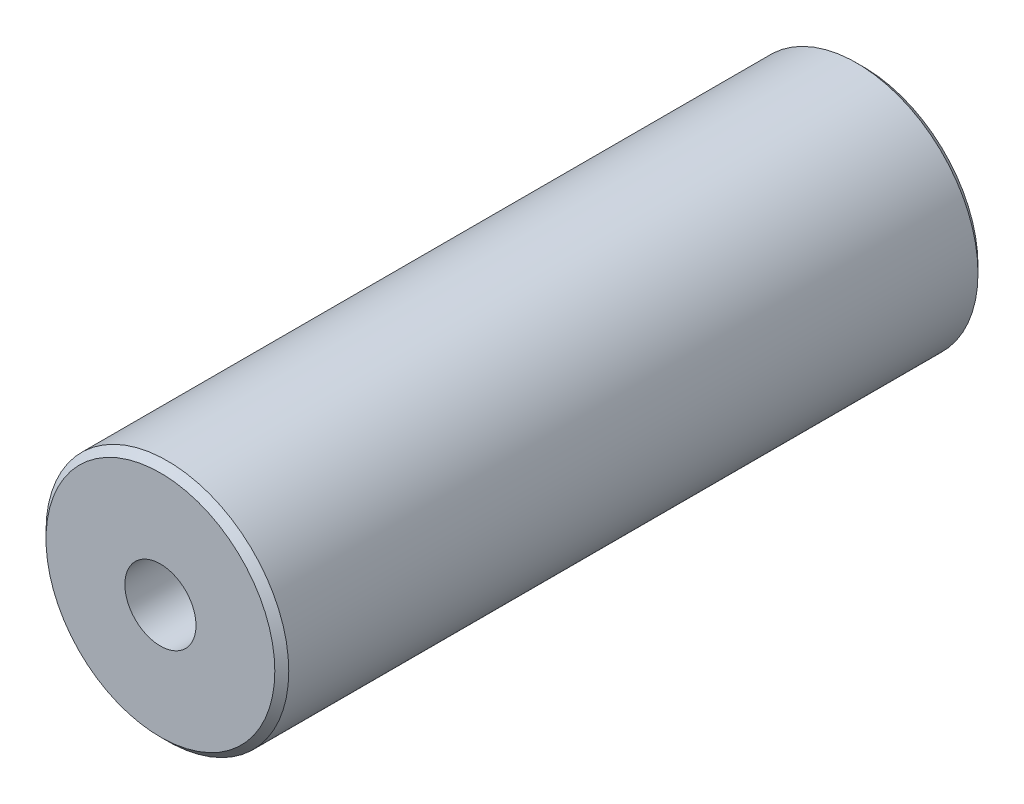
from build123d import *

# Parameters (mm, degrees)
BASE_EXTRUDE_DEPTH       = 25.2
BASE_EXTRUDE_DEPTH_BACK  = 25.2
SKETCH1_R                = 8.7
STROKECHAMBER_DEPTH      = 15.2
STROKECHAMBER_DEPTH_BACK = 15.2
SKETCH2_R                = 8
CHAMFER1_SIZE            = 0.5
SKETCH3_R                = 2.55
THRUBORE_DEPTH           = 29.043180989
SKETCH4_R                = 2.55
CUT_EXTRUDE1_DEPTH       = 52.880053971


with BuildPart() as part:
    # Sketch1 → Base-Extrude (new, two sides: drawn at the far end of the back side and taken through both)
    with BuildSketch(Plane.XY.offset(-BASE_EXTRUDE_DEPTH_BACK)):
        Circle(SKETCH1_R)
    extrude(amount=BASE_EXTRUDE_DEPTH + BASE_EXTRUDE_DEPTH_BACK)

    # Sketch2 → StrokeChamber (cut, two sides: drawn at the far end of the back side and taken through both)
    with BuildSketch(Plane.XY.offset(-STROKECHAMBER_DEPTH_BACK)):
        with Locations(Location((0, 0, 0), (0, 0, 180))):
            Circle(SKETCH2_R)
    extrude(amount=STROKECHAMBER_DEPTH + STROKECHAMBER_DEPTH_BACK, mode=Mode.SUBTRACT)

    # Chamfer1
    chamfer1_edges = [part.edges().sort_by_distance(p)[0] for p in [
        (-8.7, 0, 25.2),
        (-8.7, 0, -25.2),
    ]]
    chamfer(chamfer1_edges, length=CHAMFER1_SIZE)

    # Sketch3 → Thrubore (cut, through all)
    with BuildSketch(Plane.XY):
        Circle(SKETCH3_R)
    extrude(amount=THRUBORE_DEPTH, mode=Mode.SUBTRACT)

    # Sketch4 → Cut-Extrude1 (cut, through all)
    with BuildSketch(Plane.XY.offset(25.2)):
        Circle(SKETCH4_R)
    extrude(amount=-CUT_EXTRUDE1_DEPTH, mode=Mode.SUBTRACT)


solid = part.part
